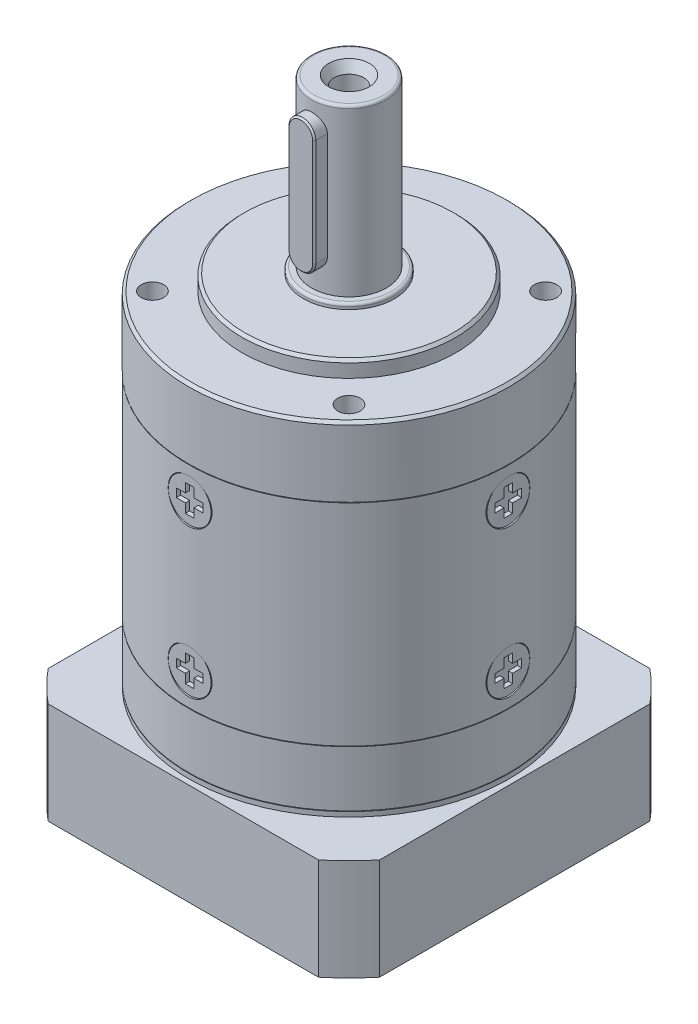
from build123d import *

# Parameters (mm, degrees)
SKETCH_1_R                = 20
EXTRUDE_1_DEPTH           = 3
SKETCH_2_R                = 30
EXTRUDE_2_DEPTH           = 13
SKETCH_3_R                = 30
EXTRUDE_3_DEPTH           = 39.4
SKETCH_4_R                = 30
EXTRUDE_4_DEPTH           = 10.4
SKETCH_5_R                = 30
EXTRUDE_5_DEPTH           = 0.9
EXTRUDE_6_DEPTH           = 19
SKETCH_7_R                = 25
CUT_EXTRUDE_1_DEPTH       = 5
SKETCH_8_R                = 17.5
CUT_EXTRUDE_2_DEPTH       = 19
SKETCH_9_R                = 16
EXTRUDE_7_DEPTH           = 17
CHAMFER_1_SIZE            = 1
SKETCH_10_R               = 7
CUT_EXTRUDE_3_DEPTH       = 32
SKETCH_11_W               = 33.69437378
SKETCH_11_H               = 1
CUT_EXTRUDE_4_DEPTH       = 17
CHAMFER_2_SIZE            = 0.5
SKETCH_12_R               = 4
CUT_EXTRUDE_5_DEPTH       = 12
PATTERN_CIRCULAR_1_COUNT  = 4
CHAMFER_3_SIZE            = 0.5
PATTERN_CIRCULAR_2_COUNT  = 4
SKETCH_15_R               = 8.5
EXTRUDE_8_DEPTH           = 1
SKETCH_16_R               = 7
EXTRUDE_9_DEPTH           = 31
FILLET_1_R                = 0.5
FILLET_2_R                = 0.5
PATTERN_CIRCULAR_4_COUNT  = 4
SKETCH_19_R               = 4.1
CUT_EXTRUDE_6_DEPTH       = 31
PATTERN_CIRCULAR_5_COUNT  = 4
SKETCH_20_R               = 4
EXTRUDE_10_DEPTH          = 0.8
PATTERN_CIRCULAR_21_COUNT = 4
SKETCH_21_R               = 3.5
EXTRUDE_11_DEPTH          = 4
PATTERN_CIRCULAR_22_COUNT = 4
EXTRUDE_12_DEPTH          = 9
CHAMFER_4_SIZE            = 0.3
SKETCH_23_R               = 2.75
CUT_EXTRUDE_7_DEPTH       = 4.8
SKETCH_24_R               = 3.8
SKETCH_25_R               = 2.75


with BuildPart() as part:
    # Sketch 1 → Extrude 1 (new body)
    with BuildSketch(Plane(origin=(0, 0, 0), x_dir=(1, 0, 0), z_dir=(0, 1, 0))):
        with Locations(Location((0, 0, 0), (0, 0, 270))):
            Circle(SKETCH_1_R)
    extrude(amount=EXTRUDE_1_DEPTH)

    # Sketch 2 → Extrude 2 (add)
    with BuildSketch(Plane.XZ):
        with Locations(Location((0, 0, 0), (0, 0, 90))):
            Circle(SKETCH_2_R)
    extrude(amount=EXTRUDE_2_DEPTH)

    # Chamfer 2
    chamfer_2_edges = [part.edges().sort_by_distance(p)[0] for p in [
        (0, 0, -30),
    ]]
    chamfer(chamfer_2_edges, length=CHAMFER_2_SIZE)

    # Chamfer 3
    chamfer_3_edges = [part.edges().sort_by_distance(p)[0] for p in [
        (0, 3, -20),
    ]]
    chamfer(chamfer_3_edges, length=CHAMFER_3_SIZE)

    # Sketch 15 → Extrude 8 (add)
    with BuildSketch(Plane(origin=(0, 3, 0), x_dir=(1, 0, 0), z_dir=(0, 1, 0))):
        with Locations(Location((0, 0, 0), (0, 0, 270))):
            Circle(SKETCH_15_R)
    extrude(amount=EXTRUDE_8_DEPTH)

    # Sketch 16 → Extrude 9 (add)
    with BuildSketch(Plane(origin=(0, 4, 0), x_dir=(1, 0, 0), z_dir=(0, 1, 0))):
        with Locations(Location((0, 0, 0), (0, 0, 90))):
            Circle(SKETCH_16_R)
    extrude(amount=EXTRUDE_9_DEPTH)

    # Fillet 1
    fillet_1_edges = [part.edges().sort_by_distance(p)[0] for p in [
        (0, 4, -8.5),
    ]]
    fillet(fillet_1_edges, radius=FILLET_1_R)

    # Fillet 2
    fillet_2_edges = [part.edges().sort_by_distance(p)[0] for p in [
        (0, 35, 7),
    ]]
    fillet(fillet_2_edges, radius=FILLET_2_R)


with BuildPart() as body_2:
    # Sketch 3 → Extrude 3 (new body)
    with BuildSketch(Plane.XZ.offset(13.1)):
        with Locations(Location((0, 0, 0), (0, 0, 270))):
            Circle(SKETCH_3_R)
    extrude(amount=EXTRUDE_3_DEPTH)


with BuildPart() as body_3:
    # Sketch 4 → Extrude 4 (new body)
    with BuildSketch(Plane.XZ.offset(52.6)):
        with Locations(Location((0, 0, 0), (0, 0, 270))):
            Circle(SKETCH_4_R)
    extrude(amount=EXTRUDE_4_DEPTH)


with BuildPart() as body_4:
    # Sketch 5 → Extrude 5 (new body)
    with BuildSketch(Plane.XZ.offset(63.1)):
        with Locations(Location((0, 0, 0), (0, 0, 270))):
            Circle(SKETCH_5_R)
    extrude(amount=EXTRUDE_5_DEPTH)

    # Sketch 6 → Extrude 6 (add)
    with BuildSketch(Plane.XZ.offset(64)):
        with BuildLine():
            Line((-25.27844932, 31), (25.27844932, 31))
            ThreePointArc((25.27844932, 31), (28.284271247, 28.284271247), (31, 25.27844932))
            Line((31, 25.27844932), (31, -25.27844932))
            ThreePointArc((31, -25.27844932), (28.284271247, -28.284271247), (25.27844932, -31))
            Line((25.27844932, -31), (-25.27844932, -31))
            ThreePointArc((-25.27844932, -31), (-28.284271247, -28.284271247), (-31, -25.27844932))
            Line((-31, -25.27844932), (-31, 25.27844932))
            ThreePointArc((-31, 25.27844932), (-28.284271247, 28.284271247), (-25.27844932, 31))
        make_face()
    extrude(amount=EXTRUDE_6_DEPTH)

    # Sketch 7 → Cut-Extrude 1 (cut)
    with BuildSketch(Plane.XZ.offset(83)):
        with Locations(Location((0, 0, 0), (0, 0, 270))):
            Circle(SKETCH_7_R)
    extrude(amount=-CUT_EXTRUDE_1_DEPTH, mode=Mode.SUBTRACT)


with BuildPart() as cut_extrude_2_tool:
    # Sketch 8 → Cut-Extrude 2 (new body)
    with BuildSketch(Plane.XZ.offset(78)):
        with Locations(Location((0, 0, 0), (0, 0, 270))):
            Circle(SKETCH_8_R)
    extrude(amount=-CUT_EXTRUDE_2_DEPTH)


with BuildPart() as body_3_1:
    add(body_3.part)

    # Cut-Extrude 2: cut by cut_extrude_2_tool
    add(cut_extrude_2_tool.part, mode=Mode.SUBTRACT)

    # Sketch 9 → Extrude 7 (add)
    with BuildSketch(Plane.XZ.offset(76)):
        with Locations(Location((0, 0, 0), (0, 0, 270))):
            Circle(SKETCH_9_R)
    extrude(amount=-EXTRUDE_7_DEPTH)

    # Chamfer 1
    chamfer_1_edges = [body_3_1.edges().sort_by_distance(p)[0] for p in [
        (0, -76, 16),
    ]]
    chamfer(chamfer_1_edges, length=CHAMFER_1_SIZE)


with BuildPart() as body_4_1:
    add(body_4.part)

    # Cut-Extrude 2: cut by cut_extrude_2_tool
    add(cut_extrude_2_tool.part, mode=Mode.SUBTRACT)

    # Sketch 12 → Cut-Extrude 5 (cut)
    with BuildSketch(Plane.XZ.offset(83)):
        with Locations(Location((-12.75, 22.083647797, 0), (0, 0, 270))):
            Circle(SKETCH_12_R)
    cut_extrude_5 = extrude(amount=-CUT_EXTRUDE_5_DEPTH, mode=Mode.SUBTRACT)

    # Pattern Circular 1: Cut-Extrude 5 ×4 about axis
    pattern_circular_1_axis = Axis((0, 0, 0), (0, 1, 0))
    for i in range(1, PATTERN_CIRCULAR_1_COUNT):
        add(cut_extrude_5.rotate(pattern_circular_1_axis, i * 360 / PATTERN_CIRCULAR_1_COUNT), mode=Mode.SUBTRACT)

    # Sketch 14 → Hole Wizard M4 _1 (revolve, cut)
    with BuildSketch(Plane(origin=(-24.748737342, -83, -24.748737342), x_dir=(0, 0, -1), z_dir=(1, 0, 0))):
        Polygon((0, 0), (0, 14.491420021), (1.65, 13.5), (1.65, 0), align=None)
    hole_wizard_m4_1 = revolve(axis=Axis((-24.748737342, -89.35, -24.748737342), (0, 1, 0)), mode=Mode.SUBTRACT)

    # Pattern Circular 2: Hole Wizard M4 _1 ×4 about axis
    pattern_circular_2_axis = Axis((0, 0, 0), (0, 1, 0))
    for i in range(1, PATTERN_CIRCULAR_2_COUNT):
        add(hole_wizard_m4_1.rotate(pattern_circular_2_axis, i * 360 / PATTERN_CIRCULAR_2_COUNT), mode=Mode.SUBTRACT)

    # Sketch 21 → Extrude 11 (add)
    with BuildSketch(Plane.XZ.offset(71)):
        with Locations(Location((-12.75, 22.083647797, 0), (0, 0, 270))):
            Circle(SKETCH_21_R)
        Polygon((-11.866340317, 23.573327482), (-13.598270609, 23.593759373), (-14.481930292, 22.104079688), (-13.633659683, 20.593968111), (-11.901729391, 20.57353622), (-11.018069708, 22.063215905), align=None, mode=Mode.SUBTRACT)
    extrude_11 = extrude(amount=EXTRUDE_11_DEPTH)

    # Pattern Circular 22: Extrude 11 ×4 about axis
    pattern_circular_22_axis = Axis((0, 0, 0), (0, 1, 0))
    for i in range(1, PATTERN_CIRCULAR_22_COUNT):
        add(extrude_11.rotate(pattern_circular_22_axis, i * 360 / PATTERN_CIRCULAR_22_COUNT))


with BuildPart() as cut_extrude_3_tool:
    # Sketch 10 → Cut-Extrude 3 (new body)
    with BuildSketch(Plane.XZ.offset(83)):
        with Locations(Location((0, 0, 0), (0, 0, 270))):
            Circle(SKETCH_10_R)
    extrude(amount=-CUT_EXTRUDE_3_DEPTH)


with BuildPart() as body_2_1:
    add(body_2.part)

    # Cut-Extrude 3: cut by cut_extrude_3_tool
    add(cut_extrude_3_tool.part, mode=Mode.SUBTRACT)


with BuildPart() as body_3_2:
    add(body_3_1.part)

    # Cut-Extrude 3: cut by cut_extrude_3_tool
    add(cut_extrude_3_tool.part, mode=Mode.SUBTRACT)

    # Sketch 11 → Cut-Extrude 4 (cut)
    with BuildSketch(Plane.XZ.offset(76)):
        with Locations((0.125567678, 0)):
            Rectangle(SKETCH_11_W, SKETCH_11_H)
    extrude(amount=-CUT_EXTRUDE_4_DEPTH, mode=Mode.SUBTRACT)


with BuildPart() as hole_wizard_m5_1_tool:
    # Sketch 18 → Hole Wizard M5 _1 (revolve)
    with BuildSketch(Plane(origin=(-18.384776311, 0, -18.384776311), x_dir=(0, 0, 1), z_dir=(1, 0, 0))):
        Polygon((0, 0), (0, 15.2618073), (2.1, 14), (2.1, 0), align=None)
    hole_wizard_m5_1 = revolve(axis=Axis((-18.384776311, 6.35, -18.384776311), (0, -1, 0)))


with BuildPart() as part_1:
    add(part.part)

    # Hole Wizard M5 _1: cut by hole_wizard_m5_1_tool
    add(hole_wizard_m5_1_tool.part, mode=Mode.SUBTRACT)


with BuildPart() as body_2_2:
    add(body_2_1.part)

    # Hole Wizard M5 _1: cut by hole_wizard_m5_1_tool
    add(hole_wizard_m5_1_tool.part, mode=Mode.SUBTRACT)


with BuildPart() as pattern_circular_4_tool:
    # Pattern Circular 4: Hole Wizard M5 _1 ×4 about axis
    pattern_circular_4_axis = Axis((0, 0, 0), (0, 1, 0))
    for i in range(1, PATTERN_CIRCULAR_4_COUNT):
        add(hole_wizard_m5_1.rotate(pattern_circular_4_axis, i * 360 / PATTERN_CIRCULAR_4_COUNT))


with BuildPart() as part_2:
    add(part_1.part)

    # Pattern Circular 4: cut by pattern_circular_4_tool
    add(pattern_circular_4_tool.part, mode=Mode.SUBTRACT)

    # Sketch 22 → Extrude 12 (add)
    with BuildSketch(Plane.XY):
        with BuildLine():
            Line((-2.5, 30), (-2.5, 10))
            ThreePointArc((-2.5, 10), (0, 7.5), (2.5, 10))
            Line((2.5, 10), (2.5, 30))
            ThreePointArc((2.5, 30), (0, 32.5), (-2.5, 30))
        make_face()
    extrude(amount=EXTRUDE_12_DEPTH)

    # Chamfer 4
    chamfer_4_edges = [part_2.edges().sort_by_distance(p)[0] for p in [
        (0, 32.5, 9),
        (-2.5, 20, 9),
        (0, 7.5, 9),
        (2.5, 20, 9),
    ]]
    chamfer(chamfer_4_edges, length=CHAMFER_4_SIZE)

    # Sketch 23 → Cut-Extrude 7 (cut)
    with BuildSketch(Plane(origin=(0, 35, 0), x_dir=(1, 0, 0), z_dir=(0, 1, 0))):
        with Locations(Location((0, 0, 0), (0, 0, 270))):
            Circle(SKETCH_23_R)
    extrude(amount=-CUT_EXTRUDE_7_DEPTH, mode=Mode.SUBTRACT)

    # Sketch 24 → Loft 1 section 0
    with BuildSketch(Plane(origin=(0, 35, 0), x_dir=(1, 0, 0), z_dir=(0, 1, 0))):
        Circle(SKETCH_24_R)
    # Sketch 25 → Loft 1 section 1
    with BuildSketch(Plane(origin=(0, 33.2, 0), x_dir=(-1, 0, 0), z_dir=(0, 1, 0))):
        Circle(SKETCH_25_R)
    loft(mode=Mode.SUBTRACT)

    # Sketch 26 → Hole Wizard M5 _2 (revolve, cut)
    with BuildSketch(Plane(origin=(0, 30.2, 0), x_dir=(0, 0, 1), z_dir=(1, 0, 0))):
        Polygon((0, 0), (0, 11.2618073), (2.1, 10), (2.1, 0), align=None)
    revolve(axis=Axis((0, 36.55, 0), (0, -1, 0)), mode=Mode.SUBTRACT)


with BuildPart() as body_2_3:
    add(body_2_2.part)

    # Pattern Circular 4: cut by pattern_circular_4_tool
    add(pattern_circular_4_tool.part, mode=Mode.SUBTRACT)

    # Sketch 19 → Cut-Extrude 6 (cut)
    with BuildSketch(Plane.XY.offset(29)):
        with Locations(Location((0, -19, 0), (0, 0, 270))):
            Circle(SKETCH_19_R)
        with Locations(Location((0, -46.6, 0), (0, 0, 270))):
            Circle(SKETCH_19_R)
    cut_extrude_6 = extrude(amount=CUT_EXTRUDE_6_DEPTH, mode=Mode.SUBTRACT)

    # Pattern Circular 5: Cut-Extrude 6 ×4 about axis
    pattern_circular_5_axis = Axis((0, 0, 0), (0, 1, 0))
    for i in range(1, PATTERN_CIRCULAR_5_COUNT):
        add(cut_extrude_6.rotate(pattern_circular_5_axis, i * 360 / PATTERN_CIRCULAR_5_COUNT), mode=Mode.SUBTRACT)

    # Sketch 20 → Extrude 10 (add)
    # profile 1 of 2: a face of its own
    with BuildSketch(Plane.XY.offset(29)):
        with Locations((0, -19)):
            Circle(SKETCH_20_R)
        Polygon((0.8, -19.8), (0.8, -21.5), (-0.8, -21.5), (-0.8, -19.8), (-2.5, -19.8), (-2.5, -18.2), (-0.8, -18.2), (-0.8, -16.5), (0.8, -16.5), (0.8, -18.2), (2.5, -18.2), (2.5, -19.8), align=None, mode=Mode.SUBTRACT)
    # profile 2 of 2: a face of its own
    with BuildSketch(Plane.XY.offset(29)):
        with Locations((0, -46.6)):
            Circle(SKETCH_20_R)
        Polygon((0.8, -47.4), (0.8, -49.1), (-0.8, -49.1), (-0.8, -47.4), (-2.5, -47.4), (-2.5, -45.8), (-0.8, -45.8), (-0.8, -44.1), (0.8, -44.1), (0.8, -45.8), (2.5, -45.8), (2.5, -47.4), align=None, mode=Mode.SUBTRACT)
    extrude_10 = extrude(amount=EXTRUDE_10_DEPTH)

    # Pattern Circular 21: Extrude 10 ×4 about axis
    pattern_circular_21_axis = Axis((0, 0, 0), (0, 1, 0))
    for i in range(1, PATTERN_CIRCULAR_21_COUNT):
        add(extrude_10.rotate(pattern_circular_21_axis, i * 360 / PATTERN_CIRCULAR_21_COUNT))


solid = Compound([body_4_1.part, body_3_2.part, part_2.part, body_2_3.part])
